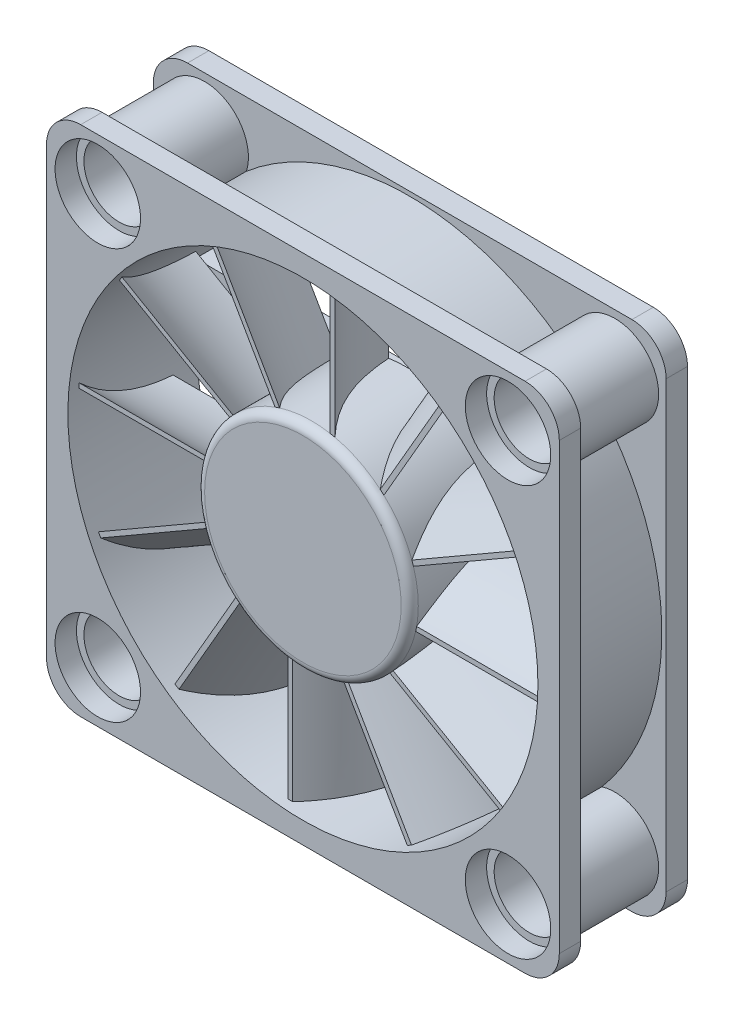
from build123d import *

# Parameters (mm, degrees)
SKETCH1_W                 = 60
SKETCH1_H                 = 60
SKETCH1_R                 = 27.5
SKETCH1_R_2               = 5
BOSS_EXTRUDE1_DEPTH       = 15
CUT_EXTRUDE1_DEPTH        = 5
CUT_EXTRUDE1_DEPTH_BACK   = 5
SKETCH2_W                 = 60
SKETCH2_H                 = 60
SKETCH2_R                 = 29.5
FILLET1_R                 = 4
SKETCH3_R                 = 5.125
SKETCH3_R_2               = 4.125
BOSS_EXTRUDE3_DEPTH       = 10
MIRROR2_COPY_1_SKETCH_R   = 5.125
MIRROR2_COPY_1_SKETCH_R_2 = 4.125
MIRROR2_COPY_1_DEPTH      = 10
BOSS_EXTRUDE4_DEPTH       = 2
BOSS_EXTRUDE5_START       = 1
SKETCH5_R                 = 12.5
BOSS_EXTRUDE5_DEPTH       = 12
FILLET2_R                 = 1
BOSS_EXTRUDE6_START       = 10
BOSS_EXTRUDE6_DEPTH       = 17.2
CUT_EXTRUDE2_DEPTH        = 12
CIRPATTERN1_COUNT         = 12


with BuildPart() as part:
    # Sketch1 → Boss-Extrude1 (new body)
    with BuildSketch(Plane.XY):
        with Locations((2.351816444, -5.277246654)):
            Rectangle(SKETCH1_W, SKETCH1_H)
        with Locations((2.351816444, -5.277246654)):
            Circle(SKETCH1_R, mode=Mode.SUBTRACT)
        with Locations((-21.648183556, 18.722753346)):
            Circle(SKETCH1_R_2, mode=Mode.SUBTRACT)
        with Locations((26.351816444, 18.722753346)):
            Circle(SKETCH1_R_2, mode=Mode.SUBTRACT)
        with Locations((26.351816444, -29.277246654)):
            Circle(SKETCH1_R_2, mode=Mode.SUBTRACT)
        with Locations((-21.648183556, -29.277246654)):
            Circle(SKETCH1_R_2, mode=Mode.SUBTRACT)
    extrude(amount=BOSS_EXTRUDE1_DEPTH)

    # Sketch2 → Cut-Extrude1 (cut, two sides: drawn at the far end of the back side and taken through both)
    with BuildSketch(Plane.XY.offset(7.5).offset(-CUT_EXTRUDE1_DEPTH_BACK)):
        with Locations((2.351816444, -5.277246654)):
            Rectangle(SKETCH2_W, SKETCH2_H)
        with Locations((2.351816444, -5.277246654)):
            Circle(SKETCH2_R, mode=Mode.SUBTRACT)
    extrude(amount=CUT_EXTRUDE1_DEPTH + CUT_EXTRUDE1_DEPTH_BACK, mode=Mode.SUBTRACT)

    # Fillet1
    fillet1_edges = [part.edges().sort_by_distance(p)[0] for p in [
        (-27.648183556, 24.722753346, 1.25),
        (32.351816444, 24.722753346, 1.25),
        (32.351816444, -35.277246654, 1.25),
        (-27.648183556, -35.277246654, 1.25),
        (-27.648183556, 24.722753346, 13.75),
        (32.351816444, 24.722753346, 13.75),
        (32.351816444, -35.277246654, 13.75),
        (-27.648183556, -35.277246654, 13.75),
    ]]
    fillet(fillet1_edges, radius=FILLET1_R)

    # Sketch3 → Boss-Extrude3 (add)
    with BuildSketch(Plane(origin=(0, 0, 12.5), x_dir=(-1, 0, 0), z_dir=(0, 0, -1))):
        with Locations((-26.351816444, 18.722753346)):
            Circle(SKETCH3_R)
        with Locations((-26.351816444, 18.722753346)):
            Circle(SKETCH3_R_2, mode=Mode.SUBTRACT)
    boss_extrude3 = extrude(amount=BOSS_EXTRUDE3_DEPTH)

    # Mirror1: Boss-Extrude3 across plane
    add(boss_extrude3.mirror(Plane(origin=(2.351816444, 0, 0), x_dir=(0, 0, 1), z_dir=(1, 0, 0))))

    # Mirror2: Boss-Extrude3 across plane
    add(boss_extrude3.mirror(Plane.ZX.offset(-5.277246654)))

    # Mirror2 copy 1 sketch → Mirror2 copy 1 (add)
    with BuildSketch(Plane(origin=(4.703632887, -10.554493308, 12.5), x_dir=(1, 0, 0), z_dir=(0, 0, -1))):
        with Locations((-26.351816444, 18.722753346)):
            Circle(MIRROR2_COPY_1_SKETCH_R)
        with Locations((-26.351816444, 18.722753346)):
            Circle(MIRROR2_COPY_1_SKETCH_R_2, mode=Mode.SUBTRACT)
    extrude(amount=MIRROR2_COPY_1_DEPTH)

    # Sketch4 → Boss-Extrude4 (add)
    with BuildSketch(Plane(origin=(0, 0, 0), x_dir=(-1, 0, 0), z_dir=(0, 0, -1))):
        with BuildLine():
            Line((23.192733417, 4.907348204), (-2.351816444, 4.722753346))
            ThreePointArc((-2.351816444, 4.722753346), (-5.684593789, 4.151040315), (-8.636292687, 2.501272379))
            Line((-8.636292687, 2.501272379), (-8.604641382, 21.502450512))
            ThreePointArc((-8.604641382, 21.502450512), (-10.593696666, 20.958633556), (-12.536411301, 20.267303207))
            Line((-12.536411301, 20.267303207), (-12.351816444, -5.277246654))
            ThreePointArc((-12.351816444, -5.277246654), (-11.780103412, -8.610024), (-10.130335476, -11.561722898))
            Line((-10.130335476, -11.561722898), (-29.131513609, -11.530071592))
            ThreePointArc((-29.131513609, -11.530071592), (-28.587696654, -13.519126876), (-27.896366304, -15.461841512))
            Line((-27.896366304, -15.461841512), (-2.351816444, -15.277246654))
            ThreePointArc((-2.351816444, -15.277246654), (0.980960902, -14.705533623), (3.9326598, -13.055765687))
            Line((3.9326598, -13.055765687), (3.9326598, -32.049533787))
            ThreePointArc((3.9326598, -32.049533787), (5.905568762, -31.508251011), (7.832778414, -30.821796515))
            Line((7.832778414, -30.821796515), (7.648183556, -5.277246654))
            ThreePointArc((7.648183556, -5.277246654), (7.076470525, -1.944469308), (5.426702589, 1.00722959))
            Line((5.426702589, 1.00722959), (24.42047069, 1.00722959))
            ThreePointArc((24.42047069, 1.00722959), (23.879187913, 2.980138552), (23.192733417, 4.907348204))
        make_face()
    extrude(amount=-BOSS_EXTRUDE4_DEPTH)


with BuildPart() as body_2:
    # Sketch5 → Boss-Extrude5 (new body)
    with BuildSketch(Plane.XY.offset(2).offset(BOSS_EXTRUDE5_START)):
        with Locations((2.351816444, -5.277246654)):
            Circle(SKETCH5_R)
    extrude(amount=BOSS_EXTRUDE5_DEPTH)

    # Fillet2
    fillet2_edges = [body_2.edges().sort_by_distance(p)[0] for p in [
        (-10.148183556, -5.277246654, 15),
    ]]
    fillet(fillet2_edges, radius=FILLET2_R)

    # Sketch6 → Boss-Extrude6 (add)
    with BuildSketch(Plane(origin=(0, -5.277246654, 0), x_dir=(1, 0, 0), z_dir=(0, 1, 0)).offset(BOSS_EXTRUDE6_START)):
        with BuildLine():
            Line((-0.150447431, -3), (0.386640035, -3))
            add(Edge.make_bspline(
                [(0.386640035, -3), (0.854849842, -9.428939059), (5.100029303, -14)],
                knots=[0, 0, 0, 1, 1, 1], degree=2))
            Line((5.100029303, -14), (4.541253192, -14))
            add(Edge.make_bspline(
                [(-0.150447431, -3), (0.32159222, -9.417919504), (4.541253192, -14)],
                knots=[0, 0, 0, 1, 1, 1], degree=2))
        make_face()
    boss_extrude6 = extrude(amount=BOSS_EXTRUDE6_DEPTH)

    # Sketch7 → Cut-Extrude2 (cut)
    with BuildSketch(Plane.XY.offset(15)):
        with BuildLine():
            Line((-0.150447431, 22.006814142), (-0.150447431, 21.760884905))
            ThreePointArc((-0.150447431, 21.760884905), (2.475369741, 21.876143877), (5.100029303, 21.736994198))
            Line((5.100029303, 21.736994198), (5.100029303, 21.983138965))
            ThreePointArc((5.100029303, 21.983138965), (2.475359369, 22.121038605), (-0.150447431, 22.006814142))
        make_face()
    extrude(amount=-CUT_EXTRUDE2_DEPTH, mode=Mode.SUBTRACT)

    # CirPattern1: Boss-Extrude6 ×12 about axis
    cirpattern1_axis = Axis((2.351816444, -5.277246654, 0), (0, 0, 1))
    for i in range(1, CIRPATTERN1_COUNT):
        add(boss_extrude6.rotate(cirpattern1_axis, i * 360 / CIRPATTERN1_COUNT))


solid = Compound([part.part, body_2.part])
